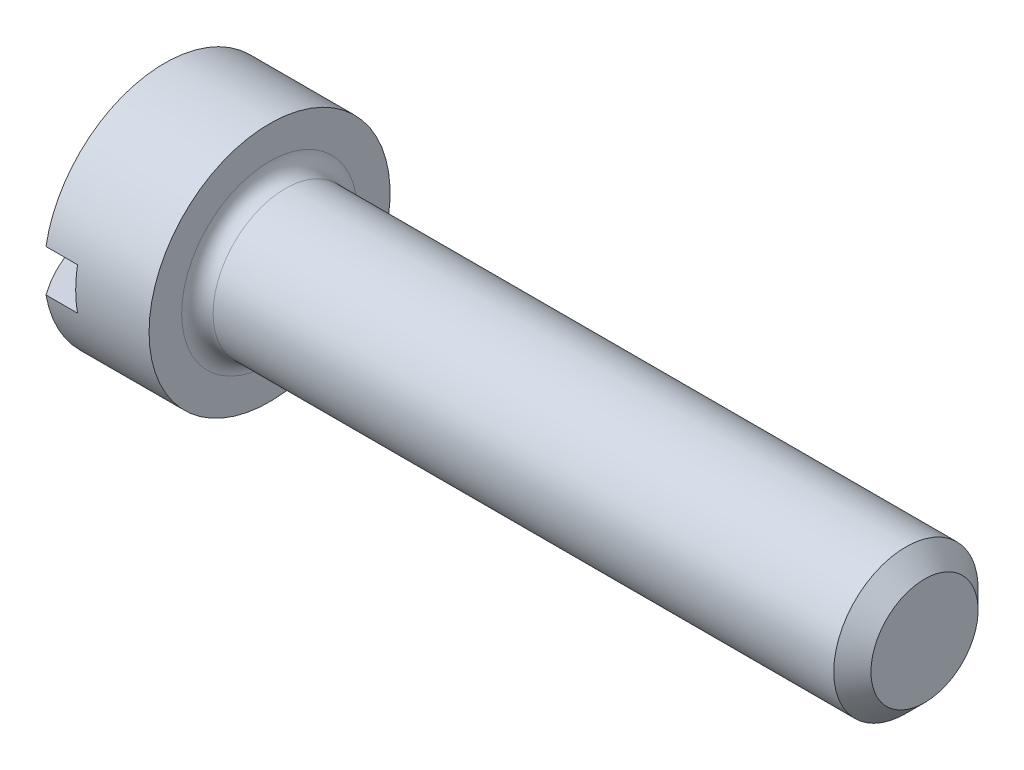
ISO-10303-21;
HEADER;
FILE_DESCRIPTION(('STEP AP214'),'2;1');
FILE_NAME('part.step','',(''),(''),'','','');
FILE_SCHEMA(('AUTOMOTIVE_DESIGN { 1 0 10303 214 1 1 1 1 }'));
ENDSEC;
DATA;
#1=APPLICATION_CONTEXT('core data for automotive mechanical design processes');
#2=APPLICATION_PROTOCOL_DEFINITION('international standard','automotive_design',2000,#1);
#3=PRODUCT_CONTEXT('',#1,'mechanical');
#4=PRODUCT('Part','Part','',(#3));
#5=PRODUCT_RELATED_PRODUCT_CATEGORY('part','',(#4));
#6=PRODUCT_DEFINITION_FORMATION('','',#4);
#7=PRODUCT_DEFINITION_CONTEXT('part definition',#1,'design');
#8=PRODUCT_DEFINITION('design','',#6,#7);
#9=PRODUCT_DEFINITION_SHAPE('','',#8);
#10=(LENGTH_UNIT() NAMED_UNIT(*) SI_UNIT(.MILLI.,.METRE.));
#11=(NAMED_UNIT(*) PLANE_ANGLE_UNIT() SI_UNIT($,.RADIAN.));
#12=(NAMED_UNIT(*) SI_UNIT($,.STERADIAN.) SOLID_ANGLE_UNIT());
#13=UNCERTAINTY_MEASURE_WITH_UNIT(LENGTH_MEASURE(1.E-05),#10,'distance_accuracy_value','');
#14=(GEOMETRIC_REPRESENTATION_CONTEXT(3) GLOBAL_UNCERTAINTY_ASSIGNED_CONTEXT((#13)) GLOBAL_UNIT_ASSIGNED_CONTEXT((#10,
#11,#12)) REPRESENTATION_CONTEXT('',''));
#15=CARTESIAN_POINT('',(0.,0.,0.));
#16=DIRECTION('',(0.,0.,1.));
#17=DIRECTION('',(1.,0.,0.));
#18=AXIS2_PLACEMENT_3D('',#15,#16,#17);
#19=CARTESIAN_POINT('',(-25.4,0.,0.));
#20=DIRECTION('',(-1.,0.,0.));
#21=DIRECTION('',(0.,0.,1.));
#22=AXIS2_PLACEMENT_3D('',#19,#20,#21);
#23=CYLINDRICAL_SURFACE('',#22,1.1684);
#24=CARTESIAN_POINT('',(1.397,0.,0.));
#25=DIRECTION('',(-1.,0.,0.));
#26=DIRECTION('',(0.,0.,1.));
#27=AXIS2_PLACEMENT_3D('',#24,#25,#26);
#28=CIRCLE('',#27,1.1684);
#29=CARTESIAN_POINT('',(1.397,0.,1.1684));
#30=VERTEX_POINT('',#29);
#31=EDGE_CURVE('E126',#30,#30,#28,.T.);
#32=ORIENTED_EDGE('',*,*,#31,.T.);
#33=EDGE_LOOP('',(#32));
#34=FACE_BOUND('',#33,.T.);
#35=CARTESIAN_POINT('',(0.37999556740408,0.,0.));
#36=DIRECTION('',(-1.,0.,0.));
#37=DIRECTION('',(0.,0.,1.));
#38=AXIS2_PLACEMENT_3D('',#35,#36,#37);
#39=CIRCLE('',#38,1.1684);
#40=CARTESIAN_POINT('',(0.37999556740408,-0.2032,-1.15059476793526));
#41=VERTEX_POINT('',#40);
#42=CARTESIAN_POINT('',(0.37999556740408,-0.2032,1.15059476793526));
#43=VERTEX_POINT('',#42);
#44=EDGE_CURVE('E128',#41,#43,#39,.T.);
#45=ORIENTED_EDGE('',*,*,#44,.F.);
#46=DIRECTION('',(-1.,0.,0.));
#47=VECTOR('',#46,1.);
#48=CARTESIAN_POINT('',(-25.4,-0.2032,-1.15059476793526));
#49=LINE('',#48,#47);
#50=CARTESIAN_POINT('',(0.6858,-0.2032,-1.15059476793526));
#51=VERTEX_POINT('',#50);
#52=EDGE_CURVE('E107',#41,#51,#49,.F.);
#53=ORIENTED_EDGE('',*,*,#52,.T.);
#54=CARTESIAN_POINT('',(0.6858,0.,0.));
#55=DIRECTION('',(-1.,0.,0.));
#56=DIRECTION('',(0.,0.,1.));
#57=AXIS2_PLACEMENT_3D('',#54,#55,#56);
#58=CIRCLE('',#57,1.1684);
#59=CARTESIAN_POINT('',(0.6858,0.2032,-1.15059476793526));
#60=VERTEX_POINT('',#59);
#61=EDGE_CURVE('E92',#51,#60,#58,.F.);
#62=ORIENTED_EDGE('',*,*,#61,.T.);
#63=DIRECTION('',(-1.,0.,0.));
#64=VECTOR('',#63,1.);
#65=CARTESIAN_POINT('',(-25.4,0.2032,-1.15059476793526));
#66=LINE('',#65,#64);
#67=CARTESIAN_POINT('',(0.37999556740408,0.2032,-1.15059476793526));
#68=VERTEX_POINT('',#67);
#69=EDGE_CURVE('E97',#60,#68,#66,.T.);
#70=ORIENTED_EDGE('',*,*,#69,.T.);
#71=CARTESIAN_POINT('',(0.37999556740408,0.2032,1.15059476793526));
#72=VERTEX_POINT('',#71);
#73=EDGE_CURVE('E101',#72,#68,#39,.T.);
#74=ORIENTED_EDGE('',*,*,#73,.F.);
#75=DIRECTION('',(-1.,0.,0.));
#76=VECTOR('',#75,1.);
#77=CARTESIAN_POINT('',(-25.4,0.2032,1.15059476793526));
#78=LINE('',#77,#76);
#79=CARTESIAN_POINT('',(0.6858,0.2032,1.15059476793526));
#80=VERTEX_POINT('',#79);
#81=EDGE_CURVE('E60',#72,#80,#78,.F.);
#82=ORIENTED_EDGE('',*,*,#81,.T.);
#83=CARTESIAN_POINT('',(0.6858,-0.2032,1.15059476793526));
#84=VERTEX_POINT('',#83);
#85=EDGE_CURVE('E81',#80,#84,#58,.F.);
#86=ORIENTED_EDGE('',*,*,#85,.T.);
#87=DIRECTION('',(-1.,0.,0.));
#88=VECTOR('',#87,1.);
#89=CARTESIAN_POINT('',(-25.4,-0.2032,1.15059476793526));
#90=LINE('',#89,#88);
#91=EDGE_CURVE('E102',#84,#43,#90,.T.);
#92=ORIENTED_EDGE('',*,*,#91,.T.);
#93=EDGE_LOOP('',(#45,#53,#62,#70,#74,#82,#86,#92));
#94=FACE_BOUND('',#93,.T.);
#95=ADVANCED_FACE('F41',(#34,#94),#23,.T.);
#96=CARTESIAN_POINT('',(1.98628,0.,0.));
#97=DIRECTION('',(-1.,0.,0.));
#98=DIRECTION('',(0.,1.,0.));
#99=AXIS2_PLACEMENT_3D('',#96,#97,#98);
#100=SPHERICAL_SURFACE('',#99,1.98628);
#101=CARTESIAN_POINT('',(1.98628,-0.2032,0.));
#102=DIRECTION('',(0.,1.,0.));
#103=DIRECTION('',(0.,0.,1.));
#104=AXIS2_PLACEMENT_3D('',#101,#102,#103);
#105=CIRCLE('',#104,1.97585880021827);
#106=EDGE_CURVE('E61',#41,#43,#105,.T.);
#107=ORIENTED_EDGE('',*,*,#106,.F.);
#108=ORIENTED_EDGE('',*,*,#44,.T.);
#109=EDGE_LOOP('',(#107,#108));
#110=FACE_BOUND('',#109,.T.);
#111=ADVANCED_FACE('F165',(#110),#100,.T.);
#112=CARTESIAN_POINT('',(1.98628,0.2032,0.));
#113=DIRECTION('',(0.,-1.,0.));
#114=DIRECTION('',(0.,0.,-1.));
#115=AXIS2_PLACEMENT_3D('',#112,#113,#114);
#116=CIRCLE('',#115,1.97585880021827);
#117=EDGE_CURVE('E131',#72,#68,#116,.T.);
#118=ORIENTED_EDGE('',*,*,#117,.F.);
#119=ORIENTED_EDGE('',*,*,#73,.T.);
#120=EDGE_LOOP('',(#118,#119));
#121=FACE_BOUND('',#120,.T.);
#122=ADVANCED_FACE('F163',(#121),#100,.T.);
#123=CARTESIAN_POINT('',(-25.4,0.,0.));
#124=DIRECTION('',(-1.,0.,0.));
#125=DIRECTION('',(0.,0.,1.));
#126=AXIS2_PLACEMENT_3D('',#123,#124,#125);
#127=CYLINDRICAL_SURFACE('',#126,0.69977);
#128=CARTESIAN_POINT('',(1.5494,0.,0.));
#129=DIRECTION('',(-1.,0.,0.));
#130=DIRECTION('',(0.,0.,1.));
#131=AXIS2_PLACEMENT_3D('',#128,#129,#130);
#132=CIRCLE('',#131,0.69977);
#133=CARTESIAN_POINT('',(1.5494,0.,0.69977));
#134=VERTEX_POINT('',#133);
#135=EDGE_CURVE('E11',#134,#134,#132,.F.);
#136=ORIENTED_EDGE('',*,*,#135,.T.);
#137=EDGE_LOOP('',(#136));
#138=FACE_BOUND('',#137,.T.);
#139=CARTESIAN_POINT('',(7.56666,0.,0.));
#140=DIRECTION('',(-1.,0.,0.));
#141=DIRECTION('',(0.,0.,1.));
#142=AXIS2_PLACEMENT_3D('',#139,#140,#141);
#143=CIRCLE('',#142,0.69977);
#144=CARTESIAN_POINT('',(7.56666,0.,0.69977));
#145=VERTEX_POINT('',#144);
#146=EDGE_CURVE('E117',#145,#145,#143,.T.);
#147=ORIENTED_EDGE('',*,*,#146,.T.);
#148=EDGE_LOOP('',(#147));
#149=FACE_BOUND('',#148,.T.);
#150=ADVANCED_FACE('F161',(#138,#149),#127,.T.);
#151=CARTESIAN_POINT('',(1.397,0.69977,0.));
#152=DIRECTION('',(-1.,0.,0.));
#153=DIRECTION('',(0.,0.,1.));
#154=AXIS2_PLACEMENT_3D('',#151,#152,#153);
#155=PLANE('',#154);
#156=CARTESIAN_POINT('',(1.397,0.,0.));
#157=DIRECTION('',(-1.,0.,0.));
#158=DIRECTION('',(0.,0.,1.));
#159=AXIS2_PLACEMENT_3D('',#156,#157,#158);
#160=CIRCLE('',#159,0.85217);
#161=CARTESIAN_POINT('',(1.397,0.,0.85217));
#162=VERTEX_POINT('',#161);
#163=EDGE_CURVE('E49',#162,#162,#160,.T.);
#164=ORIENTED_EDGE('',*,*,#163,.T.);
#165=EDGE_LOOP('',(#164));
#166=FACE_BOUND('',#165,.T.);
#167=ORIENTED_EDGE('',*,*,#31,.F.);
#168=EDGE_LOOP('',(#167));
#169=FACE_BOUND('',#168,.T.);
#170=ADVANCED_FACE('F171',(#166,#169),#155,.F.);
#171=CARTESIAN_POINT('',(7.747,0.51943,0.));
#172=DIRECTION('',(1.,0.,0.));
#173=DIRECTION('',(0.,0.,-1.));
#174=AXIS2_PLACEMENT_3D('',#171,#172,#173);
#175=PLANE('',#174);
#176=CARTESIAN_POINT('',(7.747,0.,0.));
#177=DIRECTION('',(-1.,0.,0.));
#178=DIRECTION('',(0.,0.,1.));
#179=AXIS2_PLACEMENT_3D('',#176,#177,#178);
#180=CIRCLE('',#179,0.51943);
#181=CARTESIAN_POINT('',(7.747,0.,0.51943));
#182=VERTEX_POINT('',#181);
#183=EDGE_CURVE('E125',#182,#182,#180,.T.);
#184=ORIENTED_EDGE('',*,*,#183,.F.);
#185=EDGE_LOOP('',(#184));
#186=FACE_BOUND('',#185,.T.);
#187=ADVANCED_FACE('F182',(#186),#175,.T.);
#188=CARTESIAN_POINT('',(7.56666,0.,0.));
#189=DIRECTION('',(-1.,0.,0.));
#190=DIRECTION('',(0.,0.,1.));
#191=AXIS2_PLACEMENT_3D('',#188,#189,#190);
#192=CONICAL_SURFACE('',#191,0.69977,0.785398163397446);
#193=ORIENTED_EDGE('',*,*,#183,.T.);
#194=EDGE_LOOP('',(#193));
#195=FACE_BOUND('',#194,.T.);
#196=ORIENTED_EDGE('',*,*,#146,.F.);
#197=EDGE_LOOP('',(#196));
#198=FACE_BOUND('',#197,.T.);
#199=ADVANCED_FACE('F189',(#195,#198),#192,.T.);
#200=CARTESIAN_POINT('',(0.,-0.2032,-1.1684));
#201=DIRECTION('',(0.,1.,0.));
#202=DIRECTION('',(0.,0.,1.));
#203=AXIS2_PLACEMENT_3D('',#200,#201,#202);
#204=PLANE('',#203);
#205=ORIENTED_EDGE('',*,*,#106,.T.);
#206=ORIENTED_EDGE('',*,*,#91,.F.);
#207=DIRECTION('',(0.,0.,1.));
#208=VECTOR('',#207,1.);
#209=CARTESIAN_POINT('',(0.6858,-0.2032,-1.1684));
#210=LINE('',#209,#208);
#211=EDGE_CURVE('E88',#51,#84,#210,.T.);
#212=ORIENTED_EDGE('',*,*,#211,.F.);
#213=ORIENTED_EDGE('',*,*,#52,.F.);
#214=EDGE_LOOP('',(#205,#206,#212,#213));
#215=FACE_BOUND('',#214,.T.);
#216=ADVANCED_FACE('F143',(#215),#204,.T.);
#217=CARTESIAN_POINT('',(0.,0.2032,1.1684));
#218=DIRECTION('',(0.,-1.,0.));
#219=DIRECTION('',(0.,0.,-1.));
#220=AXIS2_PLACEMENT_3D('',#217,#218,#219);
#221=PLANE('',#220);
#222=ORIENTED_EDGE('',*,*,#117,.T.);
#223=ORIENTED_EDGE('',*,*,#69,.F.);
#224=DIRECTION('',(0.,0.,-1.));
#225=VECTOR('',#224,1.);
#226=CARTESIAN_POINT('',(0.6858,0.2032,1.1684));
#227=LINE('',#226,#225);
#228=EDGE_CURVE('E89',#80,#60,#227,.T.);
#229=ORIENTED_EDGE('',*,*,#228,.F.);
#230=ORIENTED_EDGE('',*,*,#81,.F.);
#231=EDGE_LOOP('',(#222,#223,#229,#230));
#232=FACE_BOUND('',#231,.T.);
#233=ADVANCED_FACE('F94',(#232),#221,.T.);
#234=CARTESIAN_POINT('',(0.6858,0.2032,-1.1684));
#235=DIRECTION('',(-1.,0.,0.));
#236=DIRECTION('',(0.,0.,1.));
#237=AXIS2_PLACEMENT_3D('',#234,#235,#236);
#238=PLANE('',#237);
#239=ORIENTED_EDGE('',*,*,#211,.T.);
#240=ORIENTED_EDGE('',*,*,#85,.F.);
#241=ORIENTED_EDGE('',*,*,#228,.T.);
#242=ORIENTED_EDGE('',*,*,#61,.F.);
#243=EDGE_LOOP('',(#239,#240,#241,#242));
#244=FACE_BOUND('',#243,.T.);
#245=ADVANCED_FACE('F87',(#244),#238,.T.);
#246=CARTESIAN_POINT('',(1.5494,0.,0.));
#247=DIRECTION('',(-1.,0.,0.));
#248=DIRECTION('',(0.,0.,1.));
#249=AXIS2_PLACEMENT_3D('',#246,#247,#248);
#250=TOROIDAL_SURFACE('',#249,0.85217,0.1524);
#251=ORIENTED_EDGE('',*,*,#135,.F.);
#252=EDGE_LOOP('',(#251));
#253=FACE_BOUND('',#252,.T.);
#254=ORIENTED_EDGE('',*,*,#163,.F.);
#255=EDGE_LOOP('',(#254));
#256=FACE_BOUND('',#255,.T.);
#257=ADVANCED_FACE('F43',(#253,#256),#250,.F.);
#258=CLOSED_SHELL('',(#95,#111,#122,#150,#170,#187,#199,#216,#233,#245,#257));
#259=MANIFOLD_SOLID_BREP('B2',#258);
#260=ADVANCED_BREP_SHAPE_REPRESENTATION('',(#18,#259),#14);
#261=SHAPE_DEFINITION_REPRESENTATION(#9,#260);
ENDSEC;
END-ISO-10303-21;
